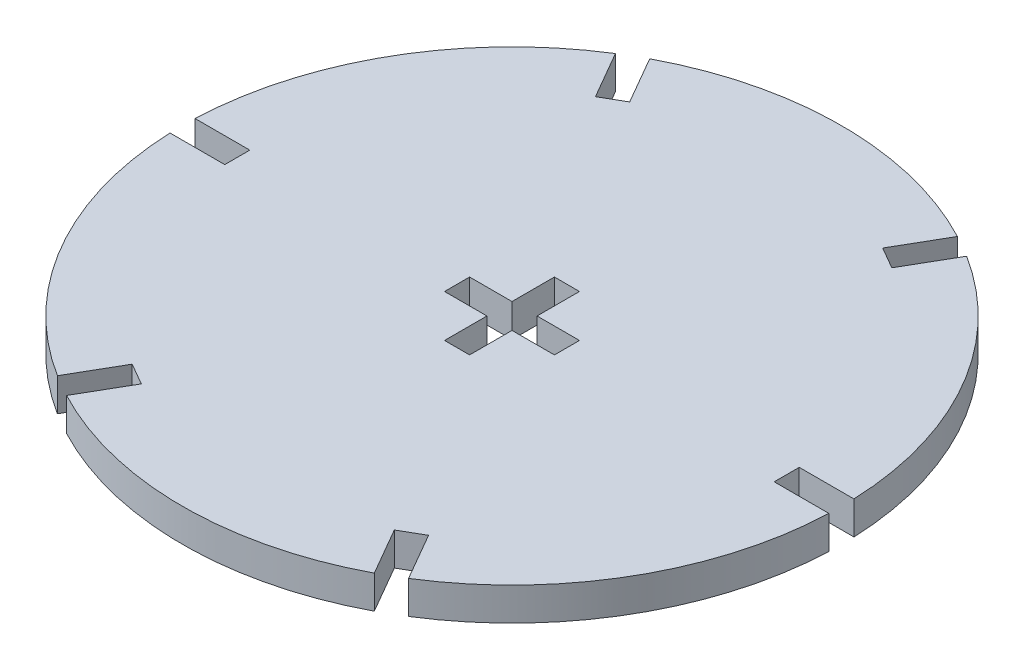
from build123d import *

# Parameters (mm, degrees)
BOSS_EXTRUDE1_DEPTH = 3
SKETCH2_W           = 2.28
SKETCH2_H           = 10
SKETCH2_W_2         = 10
SKETCH2_H_2         = 2.28
CUT_EXTRUDE1_DEPTH  = 10


with BuildPart() as part:
    # Sketch1 → Boss-Extrude1 (new body)
    with BuildSketch(Plane(origin=(0, 0, 0), x_dir=(1, 0, 0), z_dir=(0, 1, 0))):
        with BuildLine():
            ThreePointArc((-15.976435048, 25.391997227), (-25.980762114, 15), (-29.978332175, 1.14))
            Line((-29.978332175, 1.14), (-25, 1.14))
            Line((-25, 1.14), (-25, -1.14))
            Line((-25, -1.14), (-29.978332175, -1.14))
            ThreePointArc((-29.978332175, -1.14), (-25.980762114, -15), (-15.976435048, -25.391997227))
            Line((-15.976435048, -25.391997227), (-13.48726896, -21.080635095))
            Line((-13.48726896, -21.080635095), (-11.51273104, -22.220635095))
            Line((-11.51273104, -22.220635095), (-14.001897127, -26.531997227))
            ThreePointArc((-14.001897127, -26.531997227), (0, -30), (14.001897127, -26.531997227))
            Line((14.001897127, -26.531997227), (11.51273104, -22.220635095))
            Line((11.51273104, -22.220635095), (13.48726896, -21.080635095))
            Line((13.48726896, -21.080635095), (15.976435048, -25.391997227))
            ThreePointArc((15.976435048, -25.391997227), (25.980762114, -15), (29.978332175, -1.14))
            Line((29.978332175, -1.14), (25, -1.14))
            Line((25, -1.14), (25, 1.14))
            Line((25, 1.14), (29.978332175, 1.14))
            ThreePointArc((29.978332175, 1.14), (25.980762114, 15), (15.976435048, 25.391997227))
            Line((15.976435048, 25.391997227), (13.48726896, 21.080635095))
            Line((13.48726896, 21.080635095), (11.51273104, 22.220635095))
            Line((11.51273104, 22.220635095), (14.001897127, 26.531997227))
            ThreePointArc((14.001897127, 26.531997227), (0, 30), (-14.001897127, 26.531997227))
            Line((-14.001897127, 26.531997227), (-11.51273104, 22.220635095))
            Line((-11.51273104, 22.220635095), (-13.48726896, 21.080635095))
            Line((-13.48726896, 21.080635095), (-15.976435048, 25.391997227))
        make_face()
    extrude(amount=BOSS_EXTRUDE1_DEPTH)

    # Sketch2 → Cut-Extrude1 (cut)
    with BuildSketch(Plane(origin=(0, 3, 0), x_dir=(1, 0, 0), z_dir=(0, 1, 0))):
        Rectangle(SKETCH2_W, SKETCH2_H)
        Rectangle(SKETCH2_W_2, SKETCH2_H_2)
    extrude(amount=-CUT_EXTRUDE1_DEPTH, mode=Mode.SUBTRACT)


solid = part.part
